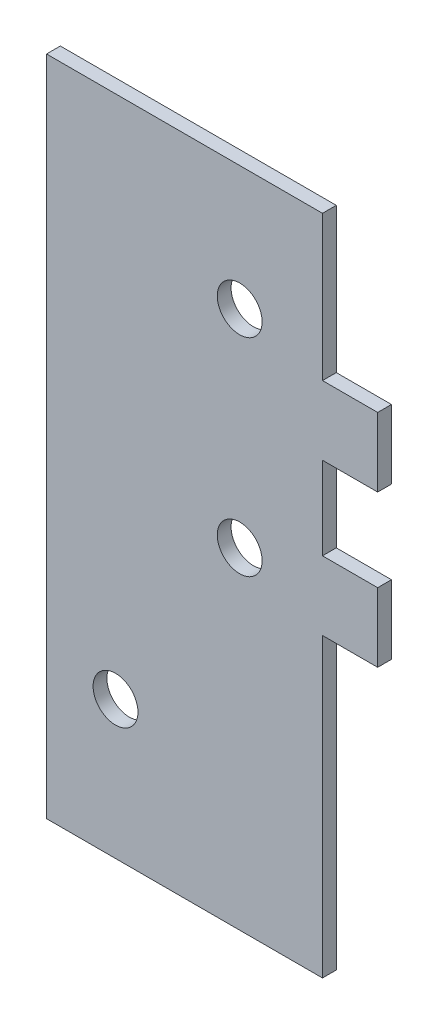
from build123d import *

# Parameters (mm, degrees)
SKETCH1_R           = 10.31875
BOSS_EXTRUDE1_DEPTH = 6.35


with BuildPart() as part:
    # Sketch1 → Boss-Extrude1 (new body)
    with BuildSketch(Plane.XY):
        Polygon((0, 0), (127, 0), (127, 136.525), (152.4, 136.525), (152.4, 168.275), (127, 168.275), (127, 206.375), (152.4, 206.375), (152.4, 238.125), (127, 238.125), (127, 304.8), (0, 304.8), align=None)
        with Locations((88.9, 247.65)):
            Circle(SKETCH1_R, mode=Mode.SUBTRACT)
        with Locations((88.9, 152.4)):
            Circle(SKETCH1_R, mode=Mode.SUBTRACT)
        with Locations((31.75, 63.5)):
            Circle(SKETCH1_R, mode=Mode.SUBTRACT)
    extrude(amount=BOSS_EXTRUDE1_DEPTH)


solid = part.part
